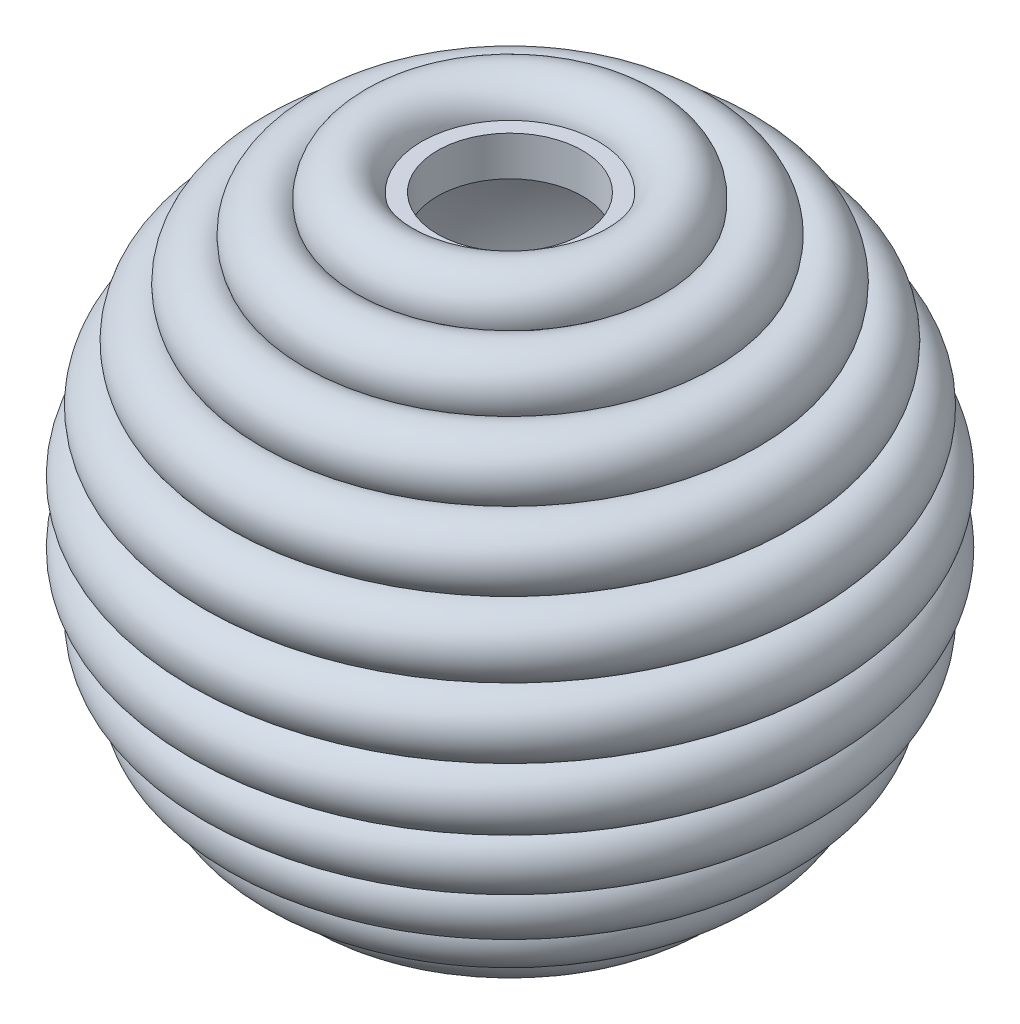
ISO-10303-21;
HEADER;
FILE_DESCRIPTION(('STEP AP214'),'2;1');
FILE_NAME('part.step','',(''),(''),'','','');
FILE_SCHEMA(('AUTOMOTIVE_DESIGN { 1 0 10303 214 1 1 1 1 }'));
ENDSEC;
DATA;
#1=APPLICATION_CONTEXT('core data for automotive mechanical design processes');
#2=APPLICATION_PROTOCOL_DEFINITION('international standard','automotive_design',2000,#1);
#3=PRODUCT_CONTEXT('',#1,'mechanical');
#4=PRODUCT('Part','Part','',(#3));
#5=PRODUCT_RELATED_PRODUCT_CATEGORY('part','',(#4));
#6=PRODUCT_DEFINITION_FORMATION('','',#4);
#7=PRODUCT_DEFINITION_CONTEXT('part definition',#1,'design');
#8=PRODUCT_DEFINITION('design','',#6,#7);
#9=PRODUCT_DEFINITION_SHAPE('','',#8);
#10=(LENGTH_UNIT() NAMED_UNIT(*) SI_UNIT(.MILLI.,.METRE.));
#11=(NAMED_UNIT(*) PLANE_ANGLE_UNIT() SI_UNIT($,.RADIAN.));
#12=(NAMED_UNIT(*) SI_UNIT($,.STERADIAN.) SOLID_ANGLE_UNIT());
#13=UNCERTAINTY_MEASURE_WITH_UNIT(LENGTH_MEASURE(1.E-05),#10,'distance_accuracy_value','');
#14=(GEOMETRIC_REPRESENTATION_CONTEXT(3) GLOBAL_UNCERTAINTY_ASSIGNED_CONTEXT((#13)) GLOBAL_UNIT_ASSIGNED_CONTEXT((#10,
#11,#12)) REPRESENTATION_CONTEXT('',''));
#15=CARTESIAN_POINT('',(0.,0.,0.));
#16=DIRECTION('',(0.,0.,1.));
#17=DIRECTION('',(1.,0.,0.));
#18=AXIS2_PLACEMENT_3D('',#15,#16,#17);
#19=CARTESIAN_POINT('',(0.,36.,0.));
#20=DIRECTION('',(0.,1.,0.));
#21=DIRECTION('',(0.,0.,1.));
#22=AXIS2_PLACEMENT_3D('',#19,#20,#21);
#23=CYLINDRICAL_SURFACE('',#22,15.);
#24=CARTESIAN_POINT('',(0.,41.1095455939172,0.));
#25=DIRECTION('',(0.,-1.,0.));
#26=DIRECTION('',(0.,0.,-1.));
#27=AXIS2_PLACEMENT_3D('',#24,#25,#26);
#28=CIRCLE('',#27,15.);
#29=CARTESIAN_POINT('',(0.,41.1095455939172,-15.));
#30=VERTEX_POINT('',#29);
#31=EDGE_CURVE('E10',#30,#30,#28,.T.);
#32=ORIENTED_EDGE('',*,*,#31,.T.);
#33=EDGE_LOOP('',(#32));
#34=FACE_BOUND('',#33,.T.);
#35=CARTESIAN_POINT('',(0.,36.,0.));
#36=DIRECTION('',(0.,1.,0.));
#37=DIRECTION('',(0.,0.,1.));
#38=AXIS2_PLACEMENT_3D('',#35,#36,#37);
#39=CIRCLE('',#38,15.);
#40=CARTESIAN_POINT('',(0.,36.,15.));
#41=VERTEX_POINT('',#40);
#42=EDGE_CURVE('E87',#41,#41,#39,.T.);
#43=ORIENTED_EDGE('',*,*,#42,.T.);
#44=EDGE_LOOP('',(#43));
#45=FACE_BOUND('',#44,.T.);
#46=ADVANCED_FACE('F31',(#34,#45),#23,.T.);
#47=CARTESIAN_POINT('',(0.,36.,0.));
#48=DIRECTION('',(0.,1.,0.));
#49=DIRECTION('',(0.,0.,1.));
#50=AXIS2_PLACEMENT_3D('',#47,#48,#49);
#51=PLANE('',#50);
#52=CARTESIAN_POINT('',(0.,36.,0.));
#53=DIRECTION('',(0.,1.,0.));
#54=DIRECTION('',(0.,0.,1.));
#55=AXIS2_PLACEMENT_3D('',#52,#53,#54);
#56=CIRCLE('',#55,11.);
#57=CARTESIAN_POINT('',(0.,36.,11.));
#58=VERTEX_POINT('',#57);
#59=EDGE_CURVE('E35',#58,#58,#56,.T.);
#60=ORIENTED_EDGE('',*,*,#59,.T.);
#61=EDGE_LOOP('',(#60));
#62=FACE_BOUND('',#61,.T.);
#63=ORIENTED_EDGE('',*,*,#42,.F.);
#64=EDGE_LOOP('',(#63));
#65=FACE_BOUND('',#64,.T.);
#66=ADVANCED_FACE('F97',(#62,#65),#51,.F.);
#67=CARTESIAN_POINT('',(0.,0.,0.));
#68=DIRECTION('',(0.,1.,0.));
#69=DIRECTION('',(1.,0.,0.));
#70=AXIS2_PLACEMENT_3D('',#67,#68,#69);
#71=SPHERICAL_SURFACE('',#70,44.);
#72=CARTESIAN_POINT('',(0.,41.1095455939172,0.));
#73=DIRECTION('',(0.,1.,0.));
#74=DIRECTION('',(0.,0.,1.));
#75=AXIS2_PLACEMENT_3D('',#72,#73,#74);
#76=CIRCLE('',#75,15.684554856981);
#77=CARTESIAN_POINT('',(0.,41.1095455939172,15.684554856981));
#78=VERTEX_POINT('',#77);
#79=EDGE_CURVE('E43',#78,#78,#76,.T.);
#80=ORIENTED_EDGE('',*,*,#79,.T.);
#81=EDGE_LOOP('',(#80));
#82=FACE_BOUND('',#81,.T.);
#83=ADVANCED_FACE('F110',(#82),#71,.F.);
#84=CARTESIAN_POINT('',(-15.684554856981,41.1095455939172,0.));
#85=DIRECTION('',(0.,-1.,0.));
#86=DIRECTION('',(0.,0.,-1.));
#87=AXIS2_PLACEMENT_3D('',#84,#85,#86);
#88=PLANE('',#87);
#89=ORIENTED_EDGE('',*,*,#31,.F.);
#90=EDGE_LOOP('',(#89));
#91=FACE_BOUND('',#90,.T.);
#92=ORIENTED_EDGE('',*,*,#79,.F.);
#93=EDGE_LOOP('',(#92));
#94=FACE_BOUND('',#93,.T.);
#95=ADVANCED_FACE('F102',(#91,#94),#88,.T.);
#96=CARTESIAN_POINT('',(0.,32.,0.));
#97=DIRECTION('',(0.,1.,0.));
#98=DIRECTION('',(0.,0.,1.));
#99=AXIS2_PLACEMENT_3D('',#96,#97,#98);
#100=CYLINDRICAL_SURFACE('',#99,11.);
#101=CARTESIAN_POINT('',(0.,42.,0.));
#102=DIRECTION('',(0.,1.,0.));
#103=DIRECTION('',(0.,0.,1.));
#104=AXIS2_PLACEMENT_3D('',#101,#102,#103);
#105=CIRCLE('',#104,11.);
#106=CARTESIAN_POINT('',(0.,42.,11.));
#107=VERTEX_POINT('',#106);
#108=EDGE_CURVE('E90',#107,#107,#105,.T.);
#109=ORIENTED_EDGE('',*,*,#108,.T.);
#110=EDGE_LOOP('',(#109));
#111=FACE_BOUND('',#110,.T.);
#112=ORIENTED_EDGE('',*,*,#59,.F.);
#113=EDGE_LOOP('',(#112));
#114=FACE_BOUND('',#113,.T.);
#115=ADVANCED_FACE('F100',(#111,#114),#100,.F.);
#116=CARTESIAN_POINT('',(0.,-45.,0.));
#117=DIRECTION('',(0.,1.,0.));
#118=DIRECTION('',(-1.,0.,0.));
#119=AXIS2_PLACEMENT_3D('',#116,#117,#118);
#120=SPHERICAL_SURFACE('',#119,5.);
#121=CARTESIAN_POINT('',(0.,-46.1944523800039,0.));
#122=DIRECTION('',(0.,1.,0.));
#123=DIRECTION('',(0.,0.,1.));
#124=AXIS2_PLACEMENT_3D('',#121,#122,#123);
#125=CIRCLE('',#124,4.85523259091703);
#126=CARTESIAN_POINT('',(0.,-46.1944523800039,4.85523259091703));
#127=VERTEX_POINT('',#126);
#128=EDGE_CURVE('E84',#127,#127,#125,.T.);
#129=ORIENTED_EDGE('',*,*,#128,.F.);
#130=EDGE_LOOP('',(#129));
#131=FACE_BOUND('',#130,.T.);
#132=ADVANCED_FACE('F33',(#131),#120,.T.);
#133=CARTESIAN_POINT('',(0.,41.1095455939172,0.));
#134=DIRECTION('',(0.,1.,0.));
#135=DIRECTION('',(0.,0.,1.));
#136=AXIS2_PLACEMENT_3D('',#133,#134,#135);
#137=TOROIDAL_SURFACE('',#136,18.3031489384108,4.99999999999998);
#138=CARTESIAN_POINT('',(0.,42.,0.));
#139=DIRECTION('',(0.,-1.,0.));
#140=DIRECTION('',(0.,0.,-1.));
#141=AXIS2_PLACEMENT_3D('',#138,#139,#140);
#142=CIRCLE('',#141,13.383078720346);
#143=CARTESIAN_POINT('',(0.,42.,-13.383078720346));
#144=VERTEX_POINT('',#143);
#145=EDGE_CURVE('E39',#144,#144,#142,.F.);
#146=ORIENTED_EDGE('',*,*,#145,.F.);
#147=EDGE_LOOP('',(#146));
#148=FACE_BOUND('',#147,.T.);
#149=CARTESIAN_POINT('',(0.,40.2259311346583,0.));
#150=DIRECTION('',(0.,1.,0.));
#151=DIRECTION('',(0.,0.,1.));
#152=AXIS2_PLACEMENT_3D('',#149,#150,#151);
#153=CIRCLE('',#152,23.224452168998);
#154=CARTESIAN_POINT('',(0.,40.2259311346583,23.224452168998));
#155=VERTEX_POINT('',#154);
#156=EDGE_CURVE('E48',#155,#155,#153,.T.);
#157=ORIENTED_EDGE('',*,*,#156,.T.);
#158=EDGE_LOOP('',(#157));
#159=FACE_BOUND('',#158,.T.);
#160=ADVANCED_FACE('F108',(#148,#159),#137,.T.);
#161=CARTESIAN_POINT('',(0.,36.4057647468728,0.));
#162=DIRECTION('',(0.,1.,0.));
#163=DIRECTION('',(0.,0.,1.));
#164=AXIS2_PLACEMENT_3D('',#161,#162,#163);
#165=TOROIDAL_SURFACE('',#164,26.4503363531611,4.99999999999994);
#166=CARTESIAN_POINT('',(0.,34.5182629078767,0.));
#167=DIRECTION('',(0.,1.,0.));
#168=DIRECTION('',(0.,0.,1.));
#169=AXIS2_PLACEMENT_3D('',#166,#167,#168);
#170=CIRCLE('',#169,31.0803835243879);
#171=CARTESIAN_POINT('',(0.,34.5182629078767,31.0803835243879));
#172=VERTEX_POINT('',#171);
#173=EDGE_CURVE('E51',#172,#172,#170,.T.);
#174=ORIENTED_EDGE('',*,*,#173,.T.);
#175=EDGE_LOOP('',(#174));
#176=FACE_BOUND('',#175,.T.);
#177=ORIENTED_EDGE('',*,*,#156,.F.);
#178=EDGE_LOOP('',(#177));
#179=FACE_BOUND('',#178,.T.);
#180=ADVANCED_FACE('F166',(#176,#179),#165,.T.);
#181=CARTESIAN_POINT('',(0.,30.1108772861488,0.));
#182=DIRECTION('',(0.,1.,0.));
#183=DIRECTION('',(0.,0.,1.));
#184=AXIS2_PLACEMENT_3D('',#181,#182,#183);
#185=TOROIDAL_SURFACE('',#184,33.4415171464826,4.99999999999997);
#186=CARTESIAN_POINT('',(0.,27.3019809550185,0.));
#187=DIRECTION('',(0.,1.,0.));
#188=DIRECTION('',(0.,0.,1.));
#189=AXIS2_PLACEMENT_3D('',#186,#187,#188);
#190=CIRCLE('',#189,37.5779529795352);
#191=CARTESIAN_POINT('',(0.,27.3019809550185,37.5779529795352));
#192=VERTEX_POINT('',#191);
#193=EDGE_CURVE('E54',#192,#192,#190,.T.);
#194=ORIENTED_EDGE('',*,*,#193,.T.);
#195=EDGE_LOOP('',(#194));
#196=FACE_BOUND('',#195,.T.);
#197=ORIENTED_EDGE('',*,*,#173,.F.);
#198=EDGE_LOOP('',(#197));
#199=FACE_BOUND('',#198,.T.);
#200=ADVANCED_FACE('F162',(#196,#199),#185,.T.);
#201=CARTESIAN_POINT('',(0.,22.5000000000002,0.));
#202=DIRECTION('',(0.,1.,0.));
#203=DIRECTION('',(0.,0.,1.));
#204=AXIS2_PLACEMENT_3D('',#201,#202,#203);
#205=TOROIDAL_SURFACE('',#204,38.9711431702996,4.99999999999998);
#206=CARTESIAN_POINT('',(0.,18.8924714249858,0.));
#207=DIRECTION('',(0.,1.,0.));
#208=DIRECTION('',(0.,0.,1.));
#209=AXIS2_PLACEMENT_3D('',#206,#207,#208);
#210=CIRCLE('',#209,42.4331855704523);
#211=CARTESIAN_POINT('',(0.,18.8924714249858,42.4331855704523));
#212=VERTEX_POINT('',#211);
#213=EDGE_CURVE('E57',#212,#212,#210,.T.);
#214=ORIENTED_EDGE('',*,*,#213,.T.);
#215=EDGE_LOOP('',(#214));
#216=FACE_BOUND('',#215,.T.);
#217=ORIENTED_EDGE('',*,*,#193,.F.);
#218=EDGE_LOOP('',(#217));
#219=FACE_BOUND('',#218,.T.);
#220=ADVANCED_FACE('F158',(#216,#219),#205,.T.);
#221=CARTESIAN_POINT('',(0.,13.9057647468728,0.));
#222=DIRECTION('',(0.,1.,0.));
#223=DIRECTION('',(0.,0.,1.));
#224=AXIS2_PLACEMENT_3D('',#221,#222,#223);
#225=TOROIDAL_SURFACE('',#224,42.7975432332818,4.99999999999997);
#226=CARTESIAN_POINT('',(0.,9.65727023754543,0.));
#227=DIRECTION('',(0.,1.,0.));
#228=DIRECTION('',(0.,0.,1.));
#229=AXIS2_PLACEMENT_3D('',#226,#227,#228);
#230=CIRCLE('',#229,45.4338843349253);
#231=CARTESIAN_POINT('',(0.,9.65727023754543,45.4338843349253));
#232=VERTEX_POINT('',#231);
#233=EDGE_CURVE('E60',#232,#232,#230,.T.);
#234=ORIENTED_EDGE('',*,*,#233,.T.);
#235=EDGE_LOOP('',(#234));
#236=FACE_BOUND('',#235,.T.);
#237=ORIENTED_EDGE('',*,*,#213,.F.);
#238=EDGE_LOOP('',(#237));
#239=FACE_BOUND('',#238,.T.);
#240=ADVANCED_FACE('F154',(#236,#239),#225,.T.);
#241=CARTESIAN_POINT('',(0.,4.70378084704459,0.));
#242=DIRECTION('',(0.,1.,0.));
#243=DIRECTION('',(0.,0.,1.));
#244=AXIS2_PLACEMENT_3D('',#241,#242,#243);
#245=TOROIDAL_SURFACE('',#244,44.7534852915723,5.);
#246=CARTESIAN_POINT('',(0.,1.80411241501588E-13,0.));
#247=DIRECTION('',(0.,1.,0.));
#248=DIRECTION('',(0.,0.,1.));
#249=AXIS2_PLACEMENT_3D('',#246,#247,#248);
#250=CIRCLE('',#249,46.4489043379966);
#251=CARTESIAN_POINT('',(0.,1.80411241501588E-13,46.4489043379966));
#252=VERTEX_POINT('',#251);
#253=EDGE_CURVE('E63',#252,#252,#250,.T.);
#254=ORIENTED_EDGE('',*,*,#253,.T.);
#255=EDGE_LOOP('',(#254));
#256=FACE_BOUND('',#255,.T.);
#257=ORIENTED_EDGE('',*,*,#233,.F.);
#258=EDGE_LOOP('',(#257));
#259=FACE_BOUND('',#258,.T.);
#260=ADVANCED_FACE('F150',(#256,#259),#245,.T.);
#261=CARTESIAN_POINT('',(0.,-4.70378084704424,0.));
#262=DIRECTION('',(0.,1.,0.));
#263=DIRECTION('',(0.,0.,1.));
#264=AXIS2_PLACEMENT_3D('',#261,#262,#263);
#265=TOROIDAL_SURFACE('',#264,44.7534852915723,5.);
#266=CARTESIAN_POINT('',(0.,-9.65727023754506,0.));
#267=DIRECTION('',(0.,1.,0.));
#268=DIRECTION('',(0.,0.,1.));
#269=AXIS2_PLACEMENT_3D('',#266,#267,#268);
#270=CIRCLE('',#269,45.4338843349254);
#271=CARTESIAN_POINT('',(0.,-9.65727023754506,45.4338843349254));
#272=VERTEX_POINT('',#271);
#273=EDGE_CURVE('E66',#272,#272,#270,.T.);
#274=ORIENTED_EDGE('',*,*,#273,.T.);
#275=EDGE_LOOP('',(#274));
#276=FACE_BOUND('',#275,.T.);
#277=ORIENTED_EDGE('',*,*,#253,.F.);
#278=EDGE_LOOP('',(#277));
#279=FACE_BOUND('',#278,.T.);
#280=ADVANCED_FACE('F146',(#276,#279),#265,.T.);
#281=CARTESIAN_POINT('',(0.,-13.9057647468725,0.));
#282=DIRECTION('',(0.,1.,0.));
#283=DIRECTION('',(0.,0.,1.));
#284=AXIS2_PLACEMENT_3D('',#281,#282,#283);
#285=TOROIDAL_SURFACE('',#284,42.797543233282,4.99999999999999);
#286=CARTESIAN_POINT('',(0.,-18.8924714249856,0.));
#287=DIRECTION('',(0.,1.,0.));
#288=DIRECTION('',(0.,0.,1.));
#289=AXIS2_PLACEMENT_3D('',#286,#287,#288);
#290=CIRCLE('',#289,42.4331855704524);
#291=CARTESIAN_POINT('',(0.,-18.8924714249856,42.4331855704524));
#292=VERTEX_POINT('',#291);
#293=EDGE_CURVE('E69',#292,#292,#290,.T.);
#294=ORIENTED_EDGE('',*,*,#293,.T.);
#295=EDGE_LOOP('',(#294));
#296=FACE_BOUND('',#295,.T.);
#297=ORIENTED_EDGE('',*,*,#273,.F.);
#298=EDGE_LOOP('',(#297));
#299=FACE_BOUND('',#298,.T.);
#300=ADVANCED_FACE('F142',(#296,#299),#285,.T.);
#301=CARTESIAN_POINT('',(0.,-22.4999999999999,0.));
#302=DIRECTION('',(0.,1.,0.));
#303=DIRECTION('',(0.,0.,1.));
#304=AXIS2_PLACEMENT_3D('',#301,#302,#303);
#305=TOROIDAL_SURFACE('',#304,38.9711431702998,4.99999999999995);
#306=CARTESIAN_POINT('',(0.,-27.3019809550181,0.));
#307=DIRECTION('',(0.,1.,0.));
#308=DIRECTION('',(0.,0.,1.));
#309=AXIS2_PLACEMENT_3D('',#306,#307,#308);
#310=CIRCLE('',#309,37.5779529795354);
#311=CARTESIAN_POINT('',(0.,-27.3019809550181,37.5779529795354));
#312=VERTEX_POINT('',#311);
#313=EDGE_CURVE('E72',#312,#312,#310,.T.);
#314=ORIENTED_EDGE('',*,*,#313,.T.);
#315=EDGE_LOOP('',(#314));
#316=FACE_BOUND('',#315,.T.);
#317=ORIENTED_EDGE('',*,*,#293,.F.);
#318=EDGE_LOOP('',(#317));
#319=FACE_BOUND('',#318,.T.);
#320=ADVANCED_FACE('F138',(#316,#319),#305,.T.);
#321=CARTESIAN_POINT('',(0.,-30.1108772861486,0.));
#322=DIRECTION('',(0.,1.,0.));
#323=DIRECTION('',(0.,0.,1.));
#324=AXIS2_PLACEMENT_3D('',#321,#322,#323);
#325=TOROIDAL_SURFACE('',#324,33.4415171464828,4.99999999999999);
#326=CARTESIAN_POINT('',(0.,-34.5182629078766,0.));
#327=DIRECTION('',(0.,1.,0.));
#328=DIRECTION('',(0.,0.,1.));
#329=AXIS2_PLACEMENT_3D('',#326,#327,#328);
#330=CIRCLE('',#329,31.0803835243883);
#331=CARTESIAN_POINT('',(0.,-34.5182629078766,31.0803835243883));
#332=VERTEX_POINT('',#331);
#333=EDGE_CURVE('E75',#332,#332,#330,.T.);
#334=ORIENTED_EDGE('',*,*,#333,.T.);
#335=EDGE_LOOP('',(#334));
#336=FACE_BOUND('',#335,.T.);
#337=ORIENTED_EDGE('',*,*,#313,.F.);
#338=EDGE_LOOP('',(#337));
#339=FACE_BOUND('',#338,.T.);
#340=ADVANCED_FACE('F134',(#336,#339),#325,.T.);
#341=CARTESIAN_POINT('',(0.,-36.4057647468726,0.));
#342=DIRECTION('',(0.,1.,0.));
#343=DIRECTION('',(0.,0.,1.));
#344=AXIS2_PLACEMENT_3D('',#341,#342,#343);
#345=TOROIDAL_SURFACE('',#344,26.4503363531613,5.);
#346=CARTESIAN_POINT('',(0.,-40.2259311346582,0.));
#347=DIRECTION('',(0.,1.,0.));
#348=DIRECTION('',(0.,0.,1.));
#349=AXIS2_PLACEMENT_3D('',#346,#347,#348);
#350=CIRCLE('',#349,23.2244521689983);
#351=CARTESIAN_POINT('',(0.,-40.2259311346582,23.2244521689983));
#352=VERTEX_POINT('',#351);
#353=EDGE_CURVE('E78',#352,#352,#350,.T.);
#354=ORIENTED_EDGE('',*,*,#353,.T.);
#355=EDGE_LOOP('',(#354));
#356=FACE_BOUND('',#355,.T.);
#357=ORIENTED_EDGE('',*,*,#333,.F.);
#358=EDGE_LOOP('',(#357));
#359=FACE_BOUND('',#358,.T.);
#360=ADVANCED_FACE('F130',(#356,#359),#345,.T.);
#361=CARTESIAN_POINT('',(0.,-41.109545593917,0.));
#362=DIRECTION('',(0.,1.,0.));
#363=DIRECTION('',(0.,0.,1.));
#364=AXIS2_PLACEMENT_3D('',#361,#362,#363);
#365=TOROIDAL_SURFACE('',#364,18.303148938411,5.);
#366=CARTESIAN_POINT('',(0.,-44.1755331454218,0.));
#367=DIRECTION('',(0.,1.,0.));
#368=DIRECTION('',(0.,0.,1.));
#369=AXIS2_PLACEMENT_3D('',#366,#367,#368);
#370=CIRCLE('',#369,14.3535008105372);
#371=CARTESIAN_POINT('',(0.,-44.1755331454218,14.3535008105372));
#372=VERTEX_POINT('',#371);
#373=EDGE_CURVE('E81',#372,#372,#370,.T.);
#374=ORIENTED_EDGE('',*,*,#373,.T.);
#375=EDGE_LOOP('',(#374));
#376=FACE_BOUND('',#375,.T.);
#377=ORIENTED_EDGE('',*,*,#353,.F.);
#378=EDGE_LOOP('',(#377));
#379=FACE_BOUND('',#378,.T.);
#380=ADVANCED_FACE('F126',(#376,#379),#365,.T.);
#381=CARTESIAN_POINT('',(0.,-44.0166420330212,0.));
#382=DIRECTION('',(0.,1.,0.));
#383=DIRECTION('',(0.,0.,1.));
#384=AXIS2_PLACEMENT_3D('',#381,#382,#383);
#385=TOROIDAL_SURFACE('',#384,9.35602608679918,5.);
#386=ORIENTED_EDGE('',*,*,#128,.T.);
#387=EDGE_LOOP('',(#386));
#388=FACE_BOUND('',#387,.T.);
#389=ORIENTED_EDGE('',*,*,#373,.F.);
#390=EDGE_LOOP('',(#389));
#391=FACE_BOUND('',#390,.T.);
#392=ADVANCED_FACE('F122',(#388,#391),#385,.T.);
#393=CARTESIAN_POINT('',(0.,42.,0.));
#394=DIRECTION('',(0.,1.,0.));
#395=DIRECTION('',(0.,0.,1.));
#396=AXIS2_PLACEMENT_3D('',#393,#394,#395);
#397=PLANE('',#396);
#398=ORIENTED_EDGE('',*,*,#108,.F.);
#399=EDGE_LOOP('',(#398));
#400=FACE_BOUND('',#399,.T.);
#401=ORIENTED_EDGE('',*,*,#145,.T.);
#402=EDGE_LOOP('',(#401));
#403=FACE_BOUND('',#402,.T.);
#404=ADVANCED_FACE('F125',(#400,#403),#397,.T.);
#405=CLOSED_SHELL('',(#46,#66,#83,#95,#115,#132,#160,#180,#200,#220,#240,#260,#280,#300,#320,
#340,#360,#380,#392,#404));
#406=MANIFOLD_SOLID_BREP('B2',#405);
#407=ADVANCED_BREP_SHAPE_REPRESENTATION('',(#18,#406),#14);
#408=SHAPE_DEFINITION_REPRESENTATION(#9,#407);
ENDSEC;
END-ISO-10303-21;
